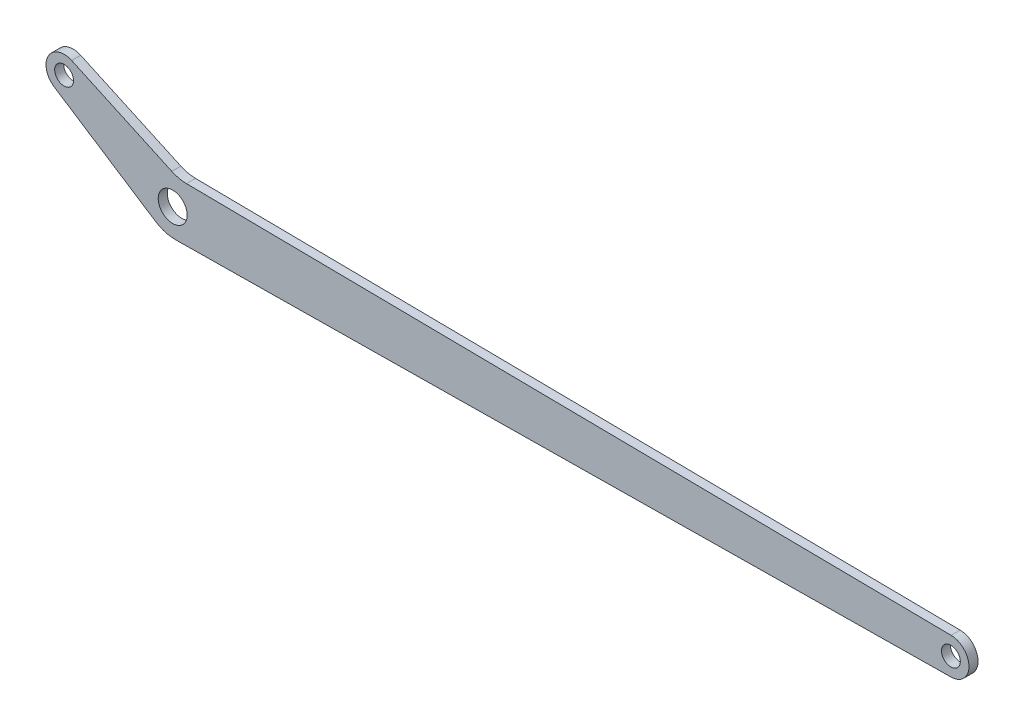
from build123d import *

# Parameters (mm, degrees)
ESQUISSE1_R        = 2.6
ESQUISSE1_R_2      = 4
BOSS_EXTRU_1_DEPTH = 2.5
CONG_1_R           = 10
CONG_2_R           = 10


with BuildPart() as part:
    # Esquisse1 → Boss.-Extru.1 (new body)
    with BuildSketch(Plane.XY):
        with BuildLine():
            Line((-217.181619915, -7.525876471), (0.058139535, -4.999661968))
            ThreePointArc((0.058139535, -4.999661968), (5, 0), (0.058139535, 4.999661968))
            Line((0.058139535, 4.999661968), (-213.321651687, 7.480990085))
            Line((-213.321651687, 7.480990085), (-242.916735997, 21.045328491))
            ThreePointArc((-242.916735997, 21.045328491), (-249.381079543, 18.909593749), (-247.723059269, 12.306558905))
            Line((-247.723059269, 12.306558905), (-217.181619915, -7.525876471))
        make_face()
        Circle(ESQUISSE1_R, mode=Mode.SUBTRACT)
        with Locations((-215, 0)):
            Circle(ESQUISSE1_R_2, mode=Mode.SUBTRACT)
        with Locations((-245, 16.5)):
            Circle(ESQUISSE1_R, mode=Mode.SUBTRACT)
    extrude(amount=BOSS_EXTRU_1_DEPTH)

    # Cong_1
    cong_1_edges = [part.edges().sort_by_distance(p)[0] for p in [
        (-213.321651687, 7.480990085, 1.25),
    ]]
    fillet(cong_1_edges, radius=CONG_1_R)

    # Cong_2
    cong_2_edges = [part.edges().sort_by_distance(p)[0] for p in [
        (-217.181619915, -7.525876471, 1.25),
    ]]
    fillet(cong_2_edges, radius=CONG_2_R)


solid = part.part
